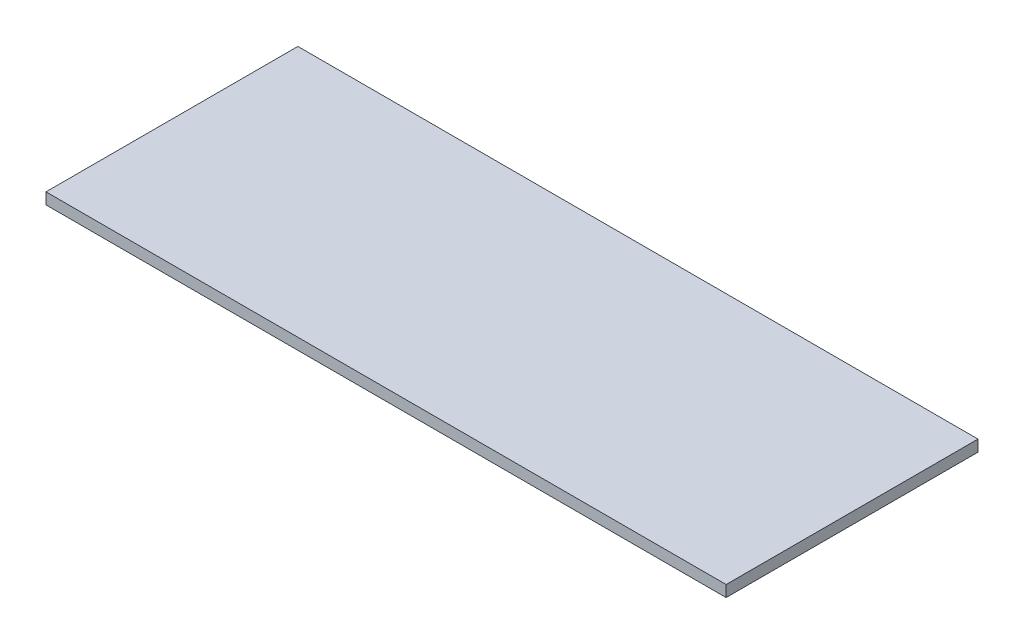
from build123d import *

# Parameters (mm, degrees)
SKETCH1_W           = 152.4
SKETCH1_H           = 56.4388
BOSS_EXTRUDE1_DEPTH = 2.54


with BuildPart() as part:
    # Sketch1 → Boss-Extrude1 (new body)
    with BuildSketch(Plane(origin=(0, 0, 0), x_dir=(1, 0, 0), z_dir=(0, 1, 0))):
        Rectangle(SKETCH1_W, SKETCH1_H)
    extrude(amount=BOSS_EXTRUDE1_DEPTH)


solid = part.part
